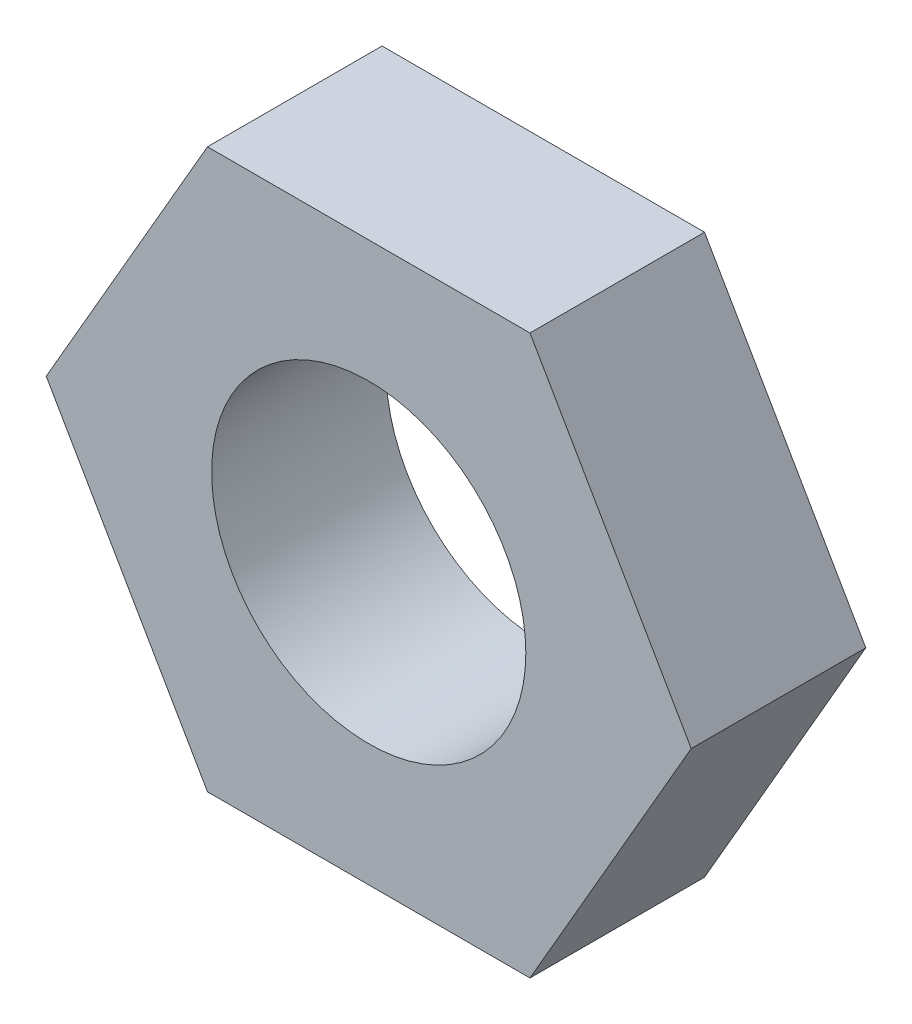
from build123d import *

# Parameters (mm, degrees)
SKETCH1_R     = 4.5
BASENUT_DEPTH = 5


with BuildPart() as part:
    # Sketch1 → BaseNut (new body)
    with BuildSketch(Plane.XY):
        Polygon((4.618802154, -8), (9.237604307, 0), (4.618802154, 8), (-4.618802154, 8), (-9.237604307, 0), (-4.618802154, -8), align=None)
        Circle(SKETCH1_R, mode=Mode.SUBTRACT)
    extrude(amount=-BASENUT_DEPTH)


solid = part.part
